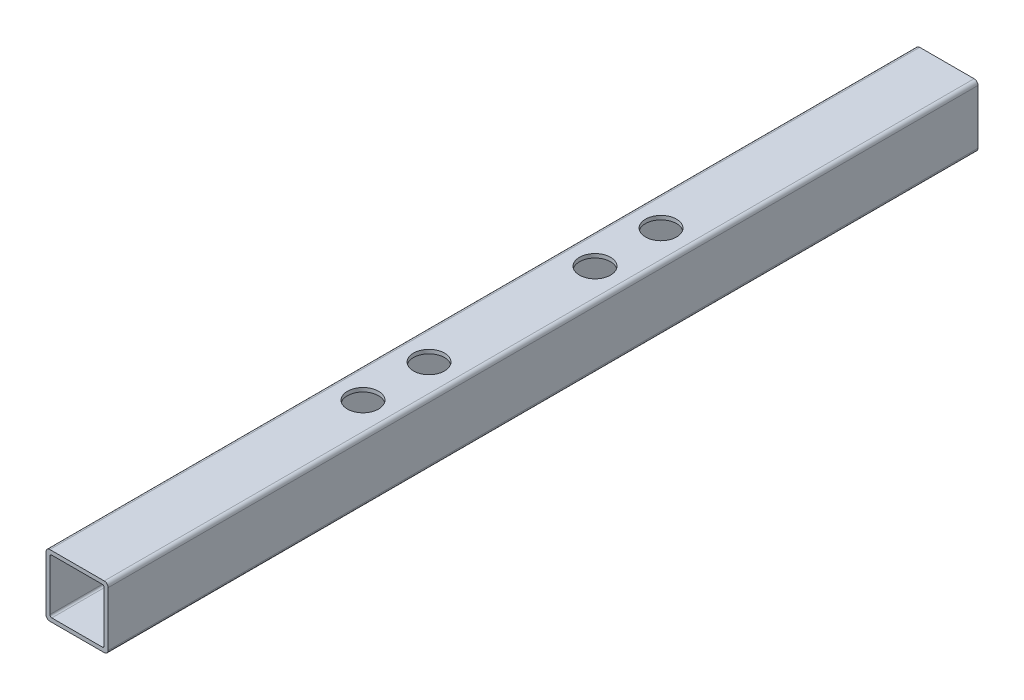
from build123d import *

# Parameters (mm, degrees)
BOSS_EXTRUDE1_DEPTH    = 355.6
F_1_1_DIAMETER_HOLE1_D = 25.4


with BuildPart() as part:
    # Sketch1 → Boss-Extrude1 (new, symmetric)
    with BuildSketch(Plane.XY):
        with BuildLine():
            Line((-22.225, 25.4), (22.225, 25.4))
            ThreePointArc((22.225, 25.4), (24.47006403, 24.47006403), (25.4, 22.225))
            Line((25.4, 22.225), (25.4, -22.225))
            ThreePointArc((25.4, -22.225), (24.47006403, -24.47006403), (22.225, -25.4))
            Line((22.225, -25.4), (-22.225, -25.4))
            ThreePointArc((-22.225, -25.4), (-24.47006403, -24.47006403), (-25.4, -22.225))
            Line((-25.4, -22.225), (-25.4, 22.225))
            ThreePointArc((-25.4, 22.225), (-24.47006403, 24.47006403), (-22.225, 25.4))
        make_face()
        with BuildLine():
            Line((-20.6375, 22.225), (20.6375, 22.225))
            ThreePointArc((20.6375, 22.225), (21.760032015, 21.760032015), (22.225, 20.6375))
            Line((22.225, 20.6375), (22.225, -20.6375))
            ThreePointArc((22.225, -20.6375), (21.760032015, -21.760032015), (20.6375, -22.225))
            Line((20.6375, -22.225), (-20.6375, -22.225))
            ThreePointArc((-20.6375, -22.225), (-21.760032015, -21.760032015), (-22.225, -20.6375))
            Line((-22.225, -20.6375), (-22.225, 20.6375))
            ThreePointArc((-22.225, 20.6375), (-21.760032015, 21.760032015), (-20.6375, 22.225))
        make_face(mode=Mode.SUBTRACT)
    extrude(amount=BOSS_EXTRUDE1_DEPTH, both=True)

    # 1 _1_ Diameter Hole1 (through all)
    with Locations(Plane(origin=(0, 25.4, 0), x_dir=(1, 0, 0), z_dir=(0, 1, 0))):
        with Locations((0, -121.840625), (0, -67.865625), (0, 67.865625), (0, 121.840625)):
            Hole(F_1_1_DIAMETER_HOLE1_D / 2)


solid = part.part
